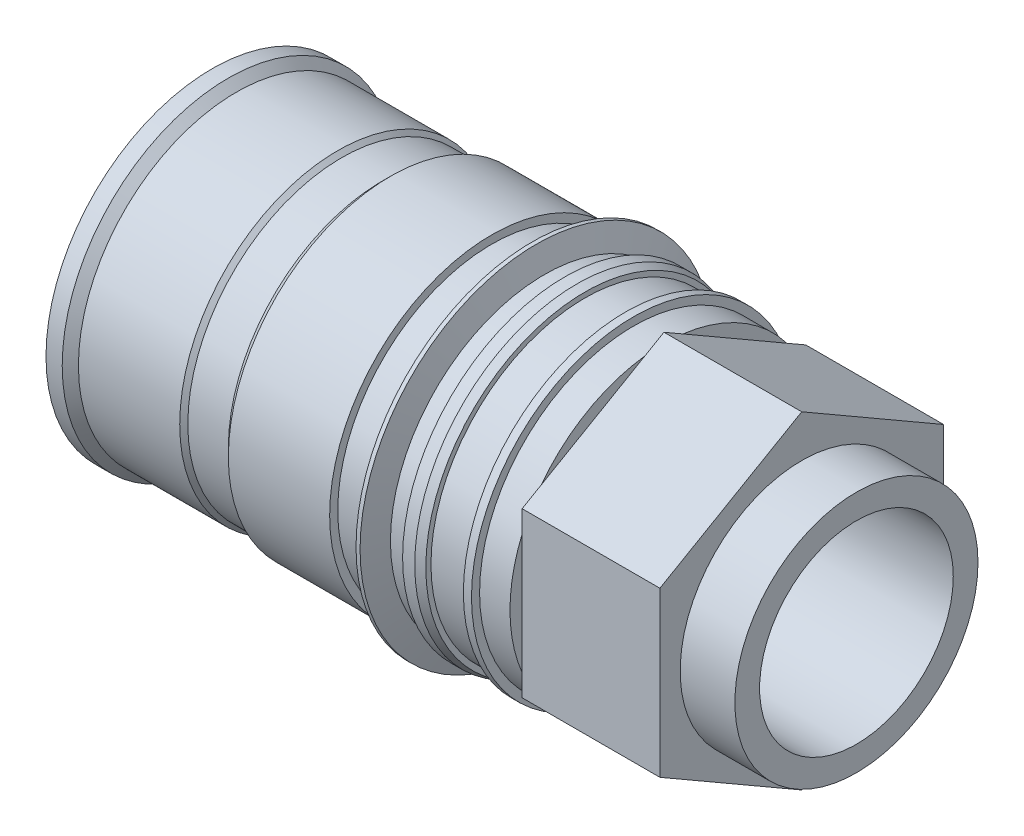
from build123d import *

# Parameters (mm, degrees)
SALIENTE_EXTRUIR1_DEPTH = 34
CROQUIS3_R              = 30
SALIENTE_EXTRUIR2_DEPTH = 13.5
CROQUIS4_R              = 23.9
CORTAR_EXTRUIR1_DEPTH   = 171.483495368


with BuildPart() as part:
    # Croquis1 → Revoluci_n1 (revolve)
    with BuildSketch(Plane.XY, mode=Mode.PRIVATE) as revoluci_n1_sk:
        Polygon((0, 0), (0, 41), (4, 41), (6, 39), (31, 39), (32, 38), (42, 38), (44, 40), (69, 40), (69, 38), (77, 38), (79, 43.494954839), (80, 43.494954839), (82, 38), (87, 38), (87, 40), (90, 40), (92, 39.272059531), (92, 38), (102, 38), (102, 40), (104, 40), (104, 38), (111.5, 38), (111.5, 0), align=None)
    revolve(revoluci_n1_sk.sketch.rotate(Axis((0, 0, 0), (1, 0, 0)), 90), axis=Axis((0, 0, 0), (1, 0, 0)))

    # Croquis2 → Saliente-Extruir1 (add)
    with BuildSketch(Plane(origin=(111.5, 0, 0), x_dir=(0, 0, -1), z_dir=(1, 0, 0))):
        Polygon((0, 40.414518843), (-35, 20.207259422), (-35, -20.207259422), (0, -40.414518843), (35, -20.207259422), (35, 20.207259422), align=None)
    extrude(amount=SALIENTE_EXTRUIR1_DEPTH)

    # Croquis3 → Saliente-Extruir2 (add)
    with BuildSketch(Plane(origin=(145.5, 0, 0), x_dir=(0, 0, -1), z_dir=(1, 0, 0))):
        Circle(CROQUIS3_R)
    extrude(amount=SALIENTE_EXTRUIR2_DEPTH)

    # Croquis4 → Cortar-Extruir1 (cut, through all)
    with BuildSketch(Plane(origin=(159, 0, 0), x_dir=(0, 0, -1), z_dir=(1, 0, 0))):
        Circle(CROQUIS4_R)
    extrude(amount=-CORTAR_EXTRUIR1_DEPTH, mode=Mode.SUBTRACT)


solid = part.part
